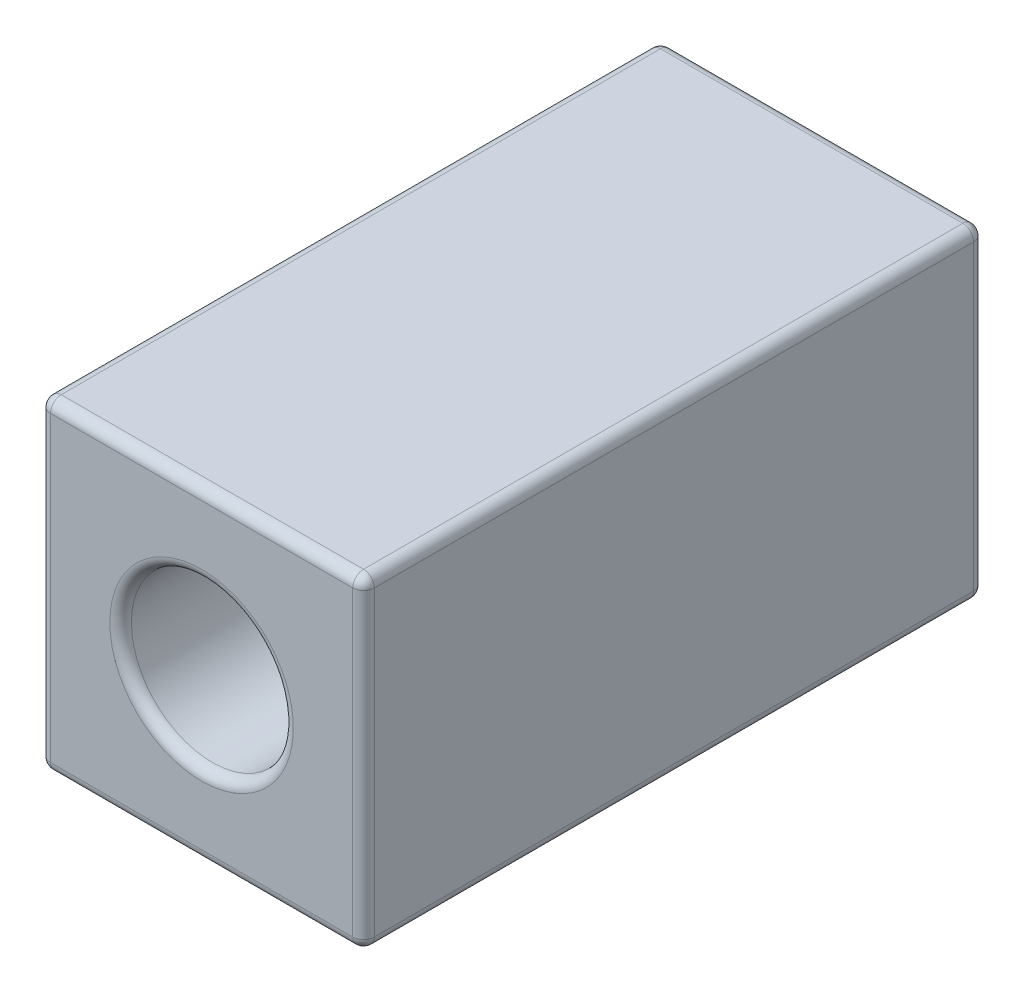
ISO-10303-21;
HEADER;
FILE_DESCRIPTION(('STEP AP214'),'2;1');
FILE_NAME('part.step','',(''),(''),'','','');
FILE_SCHEMA(('AUTOMOTIVE_DESIGN { 1 0 10303 214 1 1 1 1 }'));
ENDSEC;
DATA;
#1=APPLICATION_CONTEXT('core data for automotive mechanical design processes');
#2=APPLICATION_PROTOCOL_DEFINITION('international standard','automotive_design',2000,#1);
#3=PRODUCT_CONTEXT('',#1,'mechanical');
#4=PRODUCT('Part','Part','',(#3));
#5=PRODUCT_RELATED_PRODUCT_CATEGORY('part','',(#4));
#6=PRODUCT_DEFINITION_FORMATION('','',#4);
#7=PRODUCT_DEFINITION_CONTEXT('part definition',#1,'design');
#8=PRODUCT_DEFINITION('design','',#6,#7);
#9=PRODUCT_DEFINITION_SHAPE('','',#8);
#10=(LENGTH_UNIT() NAMED_UNIT(*) SI_UNIT(.MILLI.,.METRE.));
#11=(NAMED_UNIT(*) PLANE_ANGLE_UNIT() SI_UNIT($,.RADIAN.));
#12=(NAMED_UNIT(*) SI_UNIT($,.STERADIAN.) SOLID_ANGLE_UNIT());
#13=UNCERTAINTY_MEASURE_WITH_UNIT(LENGTH_MEASURE(1.E-05),#10,'distance_accuracy_value','');
#14=(GEOMETRIC_REPRESENTATION_CONTEXT(3) GLOBAL_UNCERTAINTY_ASSIGNED_CONTEXT((#13)) GLOBAL_UNIT_ASSIGNED_CONTEXT((#10,
#11,#12)) REPRESENTATION_CONTEXT('',''));
#15=CARTESIAN_POINT('',(0.,0.,0.));
#16=DIRECTION('',(0.,0.,1.));
#17=DIRECTION('',(1.,0.,0.));
#18=AXIS2_PLACEMENT_3D('',#15,#16,#17);
#19=CARTESIAN_POINT('',(-2.8,2.8,11.5));
#20=DIRECTION('',(0.,0.,-1.));
#21=DIRECTION('',(-1.,0.,0.));
#22=AXIS2_PLACEMENT_3D('',#19,#20,#21);
#23=PLANE('',#22);
#24=CARTESIAN_POINT('',(0.,0.,11.5));
#25=DIRECTION('',(0.,0.,-1.));
#26=DIRECTION('',(-1.,0.,0.));
#27=AXIS2_PLACEMENT_3D('',#24,#25,#26);
#28=CIRCLE('',#27,1.7);
#29=CARTESIAN_POINT('',(-1.7,0.,11.5));
#30=VERTEX_POINT('',#29);
#31=EDGE_CURVE('E11',#30,#30,#28,.T.);
#32=ORIENTED_EDGE('',*,*,#31,.T.);
#33=EDGE_LOOP('',(#32));
#34=FACE_BOUND('',#33,.T.);
#35=DIRECTION('',(0.,1.,0.));
#36=VECTOR('',#35,1.);
#37=CARTESIAN_POINT('',(2.8,2.8,11.5));
#38=LINE('',#37,#36);
#39=CARTESIAN_POINT('',(2.8,-2.8,11.5));
#40=VERTEX_POINT('',#39);
#41=CARTESIAN_POINT('',(2.8,2.8,11.5));
#42=VERTEX_POINT('',#41);
#43=EDGE_CURVE('E48',#40,#42,#38,.T.);
#44=ORIENTED_EDGE('',*,*,#43,.T.);
#45=DIRECTION('',(-1.,0.,0.));
#46=VECTOR('',#45,1.);
#47=CARTESIAN_POINT('',(-2.8,2.8,11.5));
#48=LINE('',#47,#46);
#49=CARTESIAN_POINT('',(-2.8,2.8,11.5));
#50=VERTEX_POINT('',#49);
#51=EDGE_CURVE('E41',#42,#50,#48,.T.);
#52=ORIENTED_EDGE('',*,*,#51,.T.);
#53=DIRECTION('',(0.,-1.,0.));
#54=VECTOR('',#53,1.);
#55=CARTESIAN_POINT('',(-2.8,2.8,11.5));
#56=LINE('',#55,#54);
#57=CARTESIAN_POINT('',(-2.8,-2.8,11.5));
#58=VERTEX_POINT('',#57);
#59=EDGE_CURVE('E203',#50,#58,#56,.T.);
#60=ORIENTED_EDGE('',*,*,#59,.T.);
#61=DIRECTION('',(1.,0.,0.));
#62=VECTOR('',#61,1.);
#63=CARTESIAN_POINT('',(-2.8,-2.8,11.5));
#64=LINE('',#63,#62);
#65=EDGE_CURVE('E53',#58,#40,#64,.T.);
#66=ORIENTED_EDGE('',*,*,#65,.T.);
#67=EDGE_LOOP('',(#44,#52,#60,#66));
#68=FACE_BOUND('',#67,.T.);
#69=ADVANCED_FACE('F33',(#34,#68),#23,.F.);
#70=CARTESIAN_POINT('',(-2.8,2.8,0.));
#71=DIRECTION('',(0.,0.,-1.));
#72=DIRECTION('',(-1.,0.,0.));
#73=AXIS2_PLACEMENT_3D('',#70,#71,#72);
#74=PLANE('',#73);
#75=CARTESIAN_POINT('',(0.,0.,0.));
#76=DIRECTION('',(0.,0.,-1.));
#77=DIRECTION('',(-1.,0.,0.));
#78=AXIS2_PLACEMENT_3D('',#75,#76,#77);
#79=CIRCLE('',#78,1.7);
#80=CARTESIAN_POINT('',(-1.7,0.,0.));
#81=VERTEX_POINT('',#80);
#82=EDGE_CURVE('E159',#81,#81,#79,.F.);
#83=ORIENTED_EDGE('',*,*,#82,.T.);
#84=EDGE_LOOP('',(#83));
#85=FACE_BOUND('',#84,.T.);
#86=DIRECTION('',(1.,0.,0.));
#87=VECTOR('',#86,1.);
#88=CARTESIAN_POINT('',(-2.8,-2.8,0.));
#89=LINE('',#88,#87);
#90=CARTESIAN_POINT('',(2.8,-2.8,0.));
#91=VERTEX_POINT('',#90);
#92=CARTESIAN_POINT('',(-2.8,-2.8,0.));
#93=VERTEX_POINT('',#92);
#94=EDGE_CURVE('E157',#91,#93,#89,.F.);
#95=ORIENTED_EDGE('',*,*,#94,.T.);
#96=DIRECTION('',(0.,-1.,0.));
#97=VECTOR('',#96,1.);
#98=CARTESIAN_POINT('',(-2.8,2.8,0.));
#99=LINE('',#98,#97);
#100=CARTESIAN_POINT('',(-2.8,2.8,0.));
#101=VERTEX_POINT('',#100);
#102=EDGE_CURVE('E127',#93,#101,#99,.F.);
#103=ORIENTED_EDGE('',*,*,#102,.T.);
#104=DIRECTION('',(-1.,0.,0.));
#105=VECTOR('',#104,1.);
#106=CARTESIAN_POINT('',(2.8,2.8,0.));
#107=LINE('',#106,#105);
#108=CARTESIAN_POINT('',(2.8,2.8,0.));
#109=VERTEX_POINT('',#108);
#110=EDGE_CURVE('E146',#101,#109,#107,.F.);
#111=ORIENTED_EDGE('',*,*,#110,.T.);
#112=DIRECTION('',(0.,1.,0.));
#113=VECTOR('',#112,1.);
#114=CARTESIAN_POINT('',(2.8,-2.8,0.));
#115=LINE('',#114,#113);
#116=EDGE_CURVE('E152',#109,#91,#115,.F.);
#117=ORIENTED_EDGE('',*,*,#116,.T.);
#118=EDGE_LOOP('',(#95,#103,#111,#117));
#119=FACE_BOUND('',#118,.T.);
#120=ADVANCED_FACE('F155',(#85,#119),#74,.T.);
#121=CARTESIAN_POINT('',(-2.8,2.8,11.5));
#122=DIRECTION('',(0.,0.,-1.));
#123=DIRECTION('',(-1.,0.,0.));
#124=AXIS2_PLACEMENT_3D('',#121,#122,#123);
#125=CYLINDRICAL_SURFACE('',#124,0.2);
#126=DIRECTION('',(0.,0.,-1.));
#127=VECTOR('',#126,1.);
#128=CARTESIAN_POINT('',(-2.8,3.,11.5));
#129=LINE('',#128,#127);
#130=CARTESIAN_POINT('',(-2.8,3.,11.3));
#131=VERTEX_POINT('',#130);
#132=CARTESIAN_POINT('',(-2.8,3.,0.200000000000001));
#133=VERTEX_POINT('',#132);
#134=EDGE_CURVE('E258',#131,#133,#129,.T.);
#135=ORIENTED_EDGE('',*,*,#134,.T.);
#136=CARTESIAN_POINT('',(-2.8,2.8,0.200000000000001));
#137=DIRECTION('',(0.,0.,-1.));
#138=DIRECTION('',(-1.,0.,0.));
#139=AXIS2_PLACEMENT_3D('',#136,#137,#138);
#140=CIRCLE('',#139,0.2);
#141=CARTESIAN_POINT('',(-3.,2.8,0.200000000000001));
#142=VERTEX_POINT('',#141);
#143=EDGE_CURVE('E140',#133,#142,#140,.F.);
#144=ORIENTED_EDGE('',*,*,#143,.T.);
#145=DIRECTION('',(0.,0.,-1.));
#146=VECTOR('',#145,1.);
#147=CARTESIAN_POINT('',(-3.,2.8,11.5));
#148=LINE('',#147,#146);
#149=CARTESIAN_POINT('',(-3.,2.8,11.3));
#150=VERTEX_POINT('',#149);
#151=EDGE_CURVE('E153',#150,#142,#148,.T.);
#152=ORIENTED_EDGE('',*,*,#151,.F.);
#153=CARTESIAN_POINT('',(-2.8,2.8,11.3));
#154=DIRECTION('',(0.,0.,-1.));
#155=DIRECTION('',(-1.,0.,0.));
#156=AXIS2_PLACEMENT_3D('',#153,#154,#155);
#157=CIRCLE('',#156,0.2);
#158=EDGE_CURVE('E200',#150,#131,#157,.T.);
#159=ORIENTED_EDGE('',*,*,#158,.T.);
#160=EDGE_LOOP('',(#135,#144,#152,#159));
#161=FACE_BOUND('',#160,.T.);
#162=ADVANCED_FACE('F35',(#161),#125,.T.);
#163=CARTESIAN_POINT('',(-3.,2.8,11.5));
#164=DIRECTION('',(1.,0.,0.));
#165=DIRECTION('',(0.,0.,-1.));
#166=AXIS2_PLACEMENT_3D('',#163,#164,#165);
#167=PLANE('',#166);
#168=ORIENTED_EDGE('',*,*,#151,.T.);
#169=DIRECTION('',(0.,-1.,0.));
#170=VECTOR('',#169,1.);
#171=CARTESIAN_POINT('',(-3.,-2.8,0.200000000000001));
#172=LINE('',#171,#170);
#173=CARTESIAN_POINT('',(-3.,-2.8,0.200000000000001));
#174=VERTEX_POINT('',#173);
#175=EDGE_CURVE('E130',#142,#174,#172,.T.);
#176=ORIENTED_EDGE('',*,*,#175,.T.);
#177=DIRECTION('',(0.,0.,-1.));
#178=VECTOR('',#177,1.);
#179=CARTESIAN_POINT('',(-3.,-2.8,11.5));
#180=LINE('',#179,#178);
#181=CARTESIAN_POINT('',(-3.,-2.8,11.3));
#182=VERTEX_POINT('',#181);
#183=EDGE_CURVE('E276',#182,#174,#180,.T.);
#184=ORIENTED_EDGE('',*,*,#183,.F.);
#185=DIRECTION('',(0.,-1.,0.));
#186=VECTOR('',#185,1.);
#187=CARTESIAN_POINT('',(-3.,2.8,11.3));
#188=LINE('',#187,#186);
#189=EDGE_CURVE('E172',#182,#150,#188,.F.);
#190=ORIENTED_EDGE('',*,*,#189,.T.);
#191=EDGE_LOOP('',(#168,#176,#184,#190));
#192=FACE_BOUND('',#191,.T.);
#193=ADVANCED_FACE('F299',(#192),#167,.F.);
#194=CARTESIAN_POINT('',(-2.8,-2.8,11.5));
#195=DIRECTION('',(0.,0.,-1.));
#196=DIRECTION('',(-1.,0.,0.));
#197=AXIS2_PLACEMENT_3D('',#194,#195,#196);
#198=CYLINDRICAL_SURFACE('',#197,0.2);
#199=ORIENTED_EDGE('',*,*,#183,.T.);
#200=CARTESIAN_POINT('',(-2.8,-2.8,0.200000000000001));
#201=DIRECTION('',(0.,0.,-1.));
#202=DIRECTION('',(-1.,0.,0.));
#203=AXIS2_PLACEMENT_3D('',#200,#201,#202);
#204=CIRCLE('',#203,0.2);
#205=CARTESIAN_POINT('',(-2.8,-3.,0.200000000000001));
#206=VERTEX_POINT('',#205);
#207=EDGE_CURVE('E177',#174,#206,#204,.F.);
#208=ORIENTED_EDGE('',*,*,#207,.T.);
#209=DIRECTION('',(0.,0.,-1.));
#210=VECTOR('',#209,1.);
#211=CARTESIAN_POINT('',(-2.8,-3.,11.5));
#212=LINE('',#211,#210);
#213=CARTESIAN_POINT('',(-2.8,-3.,11.3));
#214=VERTEX_POINT('',#213);
#215=EDGE_CURVE('E273',#214,#206,#212,.T.);
#216=ORIENTED_EDGE('',*,*,#215,.F.);
#217=CARTESIAN_POINT('',(-2.8,-2.8,11.3));
#218=DIRECTION('',(0.,0.,-1.));
#219=DIRECTION('',(-1.,0.,0.));
#220=AXIS2_PLACEMENT_3D('',#217,#218,#219);
#221=CIRCLE('',#220,0.2);
#222=EDGE_CURVE('E175',#214,#182,#221,.T.);
#223=ORIENTED_EDGE('',*,*,#222,.T.);
#224=EDGE_LOOP('',(#199,#208,#216,#223));
#225=FACE_BOUND('',#224,.T.);
#226=ADVANCED_FACE('F301',(#225),#198,.T.);
#227=CARTESIAN_POINT('',(-2.8,-3.,11.5));
#228=DIRECTION('',(0.,1.,0.));
#229=DIRECTION('',(0.,0.,1.));
#230=AXIS2_PLACEMENT_3D('',#227,#228,#229);
#231=PLANE('',#230);
#232=ORIENTED_EDGE('',*,*,#215,.T.);
#233=DIRECTION('',(1.,0.,0.));
#234=VECTOR('',#233,1.);
#235=CARTESIAN_POINT('',(2.8,-3.,0.200000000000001));
#236=LINE('',#235,#234);
#237=CARTESIAN_POINT('',(2.8,-3.,0.200000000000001));
#238=VERTEX_POINT('',#237);
#239=EDGE_CURVE('E181',#206,#238,#236,.T.);
#240=ORIENTED_EDGE('',*,*,#239,.T.);
#241=DIRECTION('',(0.,0.,-1.));
#242=VECTOR('',#241,1.);
#243=CARTESIAN_POINT('',(2.8,-3.,11.5));
#244=LINE('',#243,#242);
#245=CARTESIAN_POINT('',(2.8,-3.,11.3));
#246=VERTEX_POINT('',#245);
#247=EDGE_CURVE('E270',#246,#238,#244,.T.);
#248=ORIENTED_EDGE('',*,*,#247,.F.);
#249=DIRECTION('',(1.,0.,0.));
#250=VECTOR('',#249,1.);
#251=CARTESIAN_POINT('',(-2.8,-3.,11.3));
#252=LINE('',#251,#250);
#253=EDGE_CURVE('E179',#246,#214,#252,.F.);
#254=ORIENTED_EDGE('',*,*,#253,.T.);
#255=EDGE_LOOP('',(#232,#240,#248,#254));
#256=FACE_BOUND('',#255,.T.);
#257=ADVANCED_FACE('F354',(#256),#231,.F.);
#258=CARTESIAN_POINT('',(2.8,-2.8,11.5));
#259=DIRECTION('',(0.,0.,-1.));
#260=DIRECTION('',(-1.,0.,0.));
#261=AXIS2_PLACEMENT_3D('',#258,#259,#260);
#262=CYLINDRICAL_SURFACE('',#261,0.2);
#263=ORIENTED_EDGE('',*,*,#247,.T.);
#264=CARTESIAN_POINT('',(2.8,-2.8,0.200000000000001));
#265=DIRECTION('',(0.,0.,-1.));
#266=DIRECTION('',(-1.,0.,0.));
#267=AXIS2_PLACEMENT_3D('',#264,#265,#266);
#268=CIRCLE('',#267,0.2);
#269=CARTESIAN_POINT('',(3.,-2.8,0.200000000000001));
#270=VERTEX_POINT('',#269);
#271=EDGE_CURVE('E185',#238,#270,#268,.F.);
#272=ORIENTED_EDGE('',*,*,#271,.T.);
#273=DIRECTION('',(0.,0.,-1.));
#274=VECTOR('',#273,1.);
#275=CARTESIAN_POINT('',(3.,-2.8,11.5));
#276=LINE('',#275,#274);
#277=CARTESIAN_POINT('',(3.,-2.8,11.3));
#278=VERTEX_POINT('',#277);
#279=EDGE_CURVE('E267',#278,#270,#276,.T.);
#280=ORIENTED_EDGE('',*,*,#279,.F.);
#281=CARTESIAN_POINT('',(2.8,-2.8,11.3));
#282=DIRECTION('',(0.,0.,-1.));
#283=DIRECTION('',(-1.,0.,0.));
#284=AXIS2_PLACEMENT_3D('',#281,#282,#283);
#285=CIRCLE('',#284,0.2);
#286=EDGE_CURVE('E183',#278,#246,#285,.T.);
#287=ORIENTED_EDGE('',*,*,#286,.T.);
#288=EDGE_LOOP('',(#263,#272,#280,#287));
#289=FACE_BOUND('',#288,.T.);
#290=ADVANCED_FACE('F350',(#289),#262,.T.);
#291=CARTESIAN_POINT('',(3.,2.8,11.5));
#292=DIRECTION('',(-1.,0.,0.));
#293=DIRECTION('',(0.,0.,1.));
#294=AXIS2_PLACEMENT_3D('',#291,#292,#293);
#295=PLANE('',#294);
#296=ORIENTED_EDGE('',*,*,#279,.T.);
#297=DIRECTION('',(0.,1.,0.));
#298=VECTOR('',#297,1.);
#299=CARTESIAN_POINT('',(3.,2.8,0.200000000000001));
#300=LINE('',#299,#298);
#301=CARTESIAN_POINT('',(3.,2.8,0.200000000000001));
#302=VERTEX_POINT('',#301);
#303=EDGE_CURVE('E189',#270,#302,#300,.T.);
#304=ORIENTED_EDGE('',*,*,#303,.T.);
#305=DIRECTION('',(0.,0.,-1.));
#306=VECTOR('',#305,1.);
#307=CARTESIAN_POINT('',(3.,2.8,11.5));
#308=LINE('',#307,#306);
#309=CARTESIAN_POINT('',(3.,2.8,11.3));
#310=VERTEX_POINT('',#309);
#311=EDGE_CURVE('E264',#310,#302,#308,.T.);
#312=ORIENTED_EDGE('',*,*,#311,.F.);
#313=DIRECTION('',(0.,1.,0.));
#314=VECTOR('',#313,1.);
#315=CARTESIAN_POINT('',(3.,2.8,11.3));
#316=LINE('',#315,#314);
#317=EDGE_CURVE('E187',#310,#278,#316,.F.);
#318=ORIENTED_EDGE('',*,*,#317,.T.);
#319=EDGE_LOOP('',(#296,#304,#312,#318));
#320=FACE_BOUND('',#319,.T.);
#321=ADVANCED_FACE('F347',(#320),#295,.F.);
#322=CARTESIAN_POINT('',(2.8,2.8,11.5));
#323=DIRECTION('',(0.,0.,-1.));
#324=DIRECTION('',(-1.,0.,0.));
#325=AXIS2_PLACEMENT_3D('',#322,#323,#324);
#326=CYLINDRICAL_SURFACE('',#325,0.2);
#327=ORIENTED_EDGE('',*,*,#311,.T.);
#328=CARTESIAN_POINT('',(2.8,2.8,0.200000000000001));
#329=DIRECTION('',(0.,0.,-1.));
#330=DIRECTION('',(-1.,0.,0.));
#331=AXIS2_PLACEMENT_3D('',#328,#329,#330);
#332=CIRCLE('',#331,0.2);
#333=CARTESIAN_POINT('',(2.8,3.,0.200000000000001));
#334=VERTEX_POINT('',#333);
#335=EDGE_CURVE('E193',#302,#334,#332,.F.);
#336=ORIENTED_EDGE('',*,*,#335,.T.);
#337=DIRECTION('',(0.,0.,-1.));
#338=VECTOR('',#337,1.);
#339=CARTESIAN_POINT('',(2.8,3.,11.5));
#340=LINE('',#339,#338);
#341=CARTESIAN_POINT('',(2.8,3.,11.3));
#342=VERTEX_POINT('',#341);
#343=EDGE_CURVE('E261',#342,#334,#340,.T.);
#344=ORIENTED_EDGE('',*,*,#343,.F.);
#345=CARTESIAN_POINT('',(2.8,2.8,11.3));
#346=DIRECTION('',(0.,0.,-1.));
#347=DIRECTION('',(-1.,0.,0.));
#348=AXIS2_PLACEMENT_3D('',#345,#346,#347);
#349=CIRCLE('',#348,0.2);
#350=EDGE_CURVE('E191',#342,#310,#349,.T.);
#351=ORIENTED_EDGE('',*,*,#350,.T.);
#352=EDGE_LOOP('',(#327,#336,#344,#351));
#353=FACE_BOUND('',#352,.T.);
#354=ADVANCED_FACE('F323',(#353),#326,.T.);
#355=CARTESIAN_POINT('',(-2.8,3.,11.5));
#356=DIRECTION('',(0.,-1.,0.));
#357=DIRECTION('',(0.,0.,-1.));
#358=AXIS2_PLACEMENT_3D('',#355,#356,#357);
#359=PLANE('',#358);
#360=ORIENTED_EDGE('',*,*,#343,.T.);
#361=DIRECTION('',(-1.,0.,0.));
#362=VECTOR('',#361,1.);
#363=CARTESIAN_POINT('',(-2.8,3.,0.200000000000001));
#364=LINE('',#363,#362);
#365=EDGE_CURVE('E198',#334,#133,#364,.T.);
#366=ORIENTED_EDGE('',*,*,#365,.T.);
#367=ORIENTED_EDGE('',*,*,#134,.F.);
#368=DIRECTION('',(-1.,0.,0.));
#369=VECTOR('',#368,1.);
#370=CARTESIAN_POINT('',(-2.8,3.,11.3));
#371=LINE('',#370,#369);
#372=EDGE_CURVE('E195',#131,#342,#371,.F.);
#373=ORIENTED_EDGE('',*,*,#372,.T.);
#374=EDGE_LOOP('',(#360,#366,#367,#373));
#375=FACE_BOUND('',#374,.T.);
#376=ADVANCED_FACE('F322',(#375),#359,.F.);
#377=CARTESIAN_POINT('',(0.,0.,11.5));
#378=DIRECTION('',(0.,0.,-1.));
#379=DIRECTION('',(-1.,0.,0.));
#380=AXIS2_PLACEMENT_3D('',#377,#378,#379);
#381=CYLINDRICAL_SURFACE('',#380,1.5);
#382=CARTESIAN_POINT('',(0.,0.,0.200000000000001));
#383=DIRECTION('',(0.,0.,-1.));
#384=DIRECTION('',(-1.,0.,0.));
#385=AXIS2_PLACEMENT_3D('',#382,#383,#384);
#386=CIRCLE('',#385,1.5);
#387=CARTESIAN_POINT('',(-1.5,0.,0.200000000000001));
#388=VERTEX_POINT('',#387);
#389=EDGE_CURVE('E169',#388,#388,#386,.T.);
#390=ORIENTED_EDGE('',*,*,#389,.T.);
#391=EDGE_LOOP('',(#390));
#392=FACE_BOUND('',#391,.T.);
#393=CARTESIAN_POINT('',(0.,0.,11.3));
#394=DIRECTION('',(0.,0.,-1.));
#395=DIRECTION('',(-1.,0.,0.));
#396=AXIS2_PLACEMENT_3D('',#393,#394,#395);
#397=CIRCLE('',#396,1.5);
#398=CARTESIAN_POINT('',(-1.5,0.,11.3));
#399=VERTEX_POINT('',#398);
#400=EDGE_CURVE('E162',#399,#399,#397,.F.);
#401=ORIENTED_EDGE('',*,*,#400,.T.);
#402=EDGE_LOOP('',(#401));
#403=FACE_BOUND('',#402,.T.);
#404=ADVANCED_FACE('F344',(#392,#403),#381,.F.);
#405=CARTESIAN_POINT('',(0.,0.,0.200000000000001));
#406=DIRECTION('',(0.,0.,-1.));
#407=DIRECTION('',(-1.,0.,0.));
#408=AXIS2_PLACEMENT_3D('',#405,#406,#407);
#409=TOROIDAL_SURFACE('',#408,1.7,0.2);
#410=ORIENTED_EDGE('',*,*,#389,.F.);
#411=EDGE_LOOP('',(#410));
#412=FACE_BOUND('',#411,.T.);
#413=ORIENTED_EDGE('',*,*,#82,.F.);
#414=EDGE_LOOP('',(#413));
#415=FACE_BOUND('',#414,.T.);
#416=ADVANCED_FACE('F391',(#412,#415),#409,.T.);
#417=CARTESIAN_POINT('',(2.8,2.8,0.200000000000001));
#418=DIRECTION('',(0.,-1.,0.));
#419=DIRECTION('',(0.,0.,-1.));
#420=AXIS2_PLACEMENT_3D('',#417,#418,#419);
#421=CYLINDRICAL_SURFACE('',#420,0.2);
#422=CARTESIAN_POINT('',(2.8,2.8,0.200000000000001));
#423=DIRECTION('',(0.,1.,0.));
#424=DIRECTION('',(0.,0.,1.));
#425=AXIS2_PLACEMENT_3D('',#422,#423,#424);
#426=CIRCLE('',#425,0.2);
#427=EDGE_CURVE('E255',#302,#109,#426,.T.);
#428=ORIENTED_EDGE('',*,*,#427,.F.);
#429=ORIENTED_EDGE('',*,*,#303,.F.);
#430=CARTESIAN_POINT('',(2.8,-2.8,0.2));
#431=DIRECTION('',(0.,-1.,0.));
#432=DIRECTION('',(1.,0.,0.));
#433=AXIS2_PLACEMENT_3D('',#430,#431,#432);
#434=CIRCLE('',#433,0.2);
#435=EDGE_CURVE('E252',#91,#270,#434,.T.);
#436=ORIENTED_EDGE('',*,*,#435,.F.);
#437=ORIENTED_EDGE('',*,*,#116,.F.);
#438=EDGE_LOOP('',(#428,#429,#436,#437));
#439=FACE_BOUND('',#438,.T.);
#440=ADVANCED_FACE('F285',(#439),#421,.T.);
#441=CARTESIAN_POINT('',(2.8,2.8,0.200000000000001));
#442=DIRECTION('',(0.,0.,1.));
#443=DIRECTION('',(1.,0.,0.));
#444=AXIS2_PLACEMENT_3D('',#441,#442,#443);
#445=SPHERICAL_SURFACE('',#444,0.2);
#446=ORIENTED_EDGE('',*,*,#335,.F.);
#447=ORIENTED_EDGE('',*,*,#427,.T.);
#448=CARTESIAN_POINT('',(2.8,2.8,0.200000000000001));
#449=DIRECTION('',(-1.,0.,0.));
#450=DIRECTION('',(0.,-1.,0.));
#451=AXIS2_PLACEMENT_3D('',#448,#449,#450);
#452=CIRCLE('',#451,0.2);
#453=EDGE_CURVE('E149',#334,#109,#452,.T.);
#454=ORIENTED_EDGE('',*,*,#453,.F.);
#455=EDGE_LOOP('',(#446,#447,#454));
#456=FACE_BOUND('',#455,.T.);
#457=ADVANCED_FACE('F326',(#456),#445,.T.);
#458=CARTESIAN_POINT('',(2.8,-2.8,0.200000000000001));
#459=DIRECTION('',(0.,0.,1.));
#460=DIRECTION('',(1.,0.,0.));
#461=AXIS2_PLACEMENT_3D('',#458,#459,#460);
#462=SPHERICAL_SURFACE('',#461,0.2);
#463=ORIENTED_EDGE('',*,*,#435,.T.);
#464=ORIENTED_EDGE('',*,*,#271,.F.);
#465=CARTESIAN_POINT('',(2.8,-2.8,0.2));
#466=DIRECTION('',(-1.,0.,0.));
#467=DIRECTION('',(0.,-1.,0.));
#468=AXIS2_PLACEMENT_3D('',#465,#466,#467);
#469=CIRCLE('',#468,0.2);
#470=EDGE_CURVE('E143',#91,#238,#469,.T.);
#471=ORIENTED_EDGE('',*,*,#470,.F.);
#472=EDGE_LOOP('',(#463,#464,#471));
#473=FACE_BOUND('',#472,.T.);
#474=ADVANCED_FACE('F288',(#473),#462,.T.);
#475=CARTESIAN_POINT('',(-2.8,2.8,0.200000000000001));
#476=DIRECTION('',(1.,0.,0.));
#477=DIRECTION('',(0.,0.,-1.));
#478=AXIS2_PLACEMENT_3D('',#475,#476,#477);
#479=CYLINDRICAL_SURFACE('',#478,0.2);
#480=ORIENTED_EDGE('',*,*,#453,.T.);
#481=ORIENTED_EDGE('',*,*,#110,.F.);
#482=CARTESIAN_POINT('',(-2.8,2.8,0.200000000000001));
#483=DIRECTION('',(-1.,0.,0.));
#484=DIRECTION('',(0.,0.,1.));
#485=AXIS2_PLACEMENT_3D('',#482,#483,#484);
#486=CIRCLE('',#485,0.2);
#487=EDGE_CURVE('E137',#133,#101,#486,.T.);
#488=ORIENTED_EDGE('',*,*,#487,.F.);
#489=ORIENTED_EDGE('',*,*,#365,.F.);
#490=EDGE_LOOP('',(#480,#481,#488,#489));
#491=FACE_BOUND('',#490,.T.);
#492=ADVANCED_FACE('F147',(#491),#479,.T.);
#493=CARTESIAN_POINT('',(-2.8,-2.8,0.200000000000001));
#494=DIRECTION('',(-1.,0.,0.));
#495=DIRECTION('',(0.,0.,1.));
#496=AXIS2_PLACEMENT_3D('',#493,#494,#495);
#497=CYLINDRICAL_SURFACE('',#496,0.2);
#498=ORIENTED_EDGE('',*,*,#470,.T.);
#499=ORIENTED_EDGE('',*,*,#239,.F.);
#500=CARTESIAN_POINT('',(-2.8,-2.8,0.2));
#501=DIRECTION('',(-1.,0.,0.));
#502=DIRECTION('',(0.,-1.,0.));
#503=AXIS2_PLACEMENT_3D('',#500,#501,#502);
#504=CIRCLE('',#503,0.2);
#505=EDGE_CURVE('E133',#93,#206,#504,.T.);
#506=ORIENTED_EDGE('',*,*,#505,.F.);
#507=ORIENTED_EDGE('',*,*,#94,.F.);
#508=EDGE_LOOP('',(#498,#499,#506,#507));
#509=FACE_BOUND('',#508,.T.);
#510=ADVANCED_FACE('F291',(#509),#497,.T.);
#511=CARTESIAN_POINT('',(-2.8,2.8,0.200000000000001));
#512=DIRECTION('',(0.,0.,1.));
#513=DIRECTION('',(1.,0.,0.));
#514=AXIS2_PLACEMENT_3D('',#511,#512,#513);
#515=SPHERICAL_SURFACE('',#514,0.2);
#516=ORIENTED_EDGE('',*,*,#143,.F.);
#517=ORIENTED_EDGE('',*,*,#487,.T.);
#518=CARTESIAN_POINT('',(-2.8,2.8,0.200000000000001));
#519=DIRECTION('',(0.,-1.,0.));
#520=DIRECTION('',(1.,0.,0.));
#521=AXIS2_PLACEMENT_3D('',#518,#519,#520);
#522=CIRCLE('',#521,0.2);
#523=EDGE_CURVE('E123',#142,#101,#522,.T.);
#524=ORIENTED_EDGE('',*,*,#523,.F.);
#525=EDGE_LOOP('',(#516,#517,#524));
#526=FACE_BOUND('',#525,.T.);
#527=ADVANCED_FACE('F139',(#526),#515,.T.);
#528=CARTESIAN_POINT('',(-2.8,-2.8,0.200000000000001));
#529=DIRECTION('',(0.,0.,1.));
#530=DIRECTION('',(1.,0.,0.));
#531=AXIS2_PLACEMENT_3D('',#528,#529,#530);
#532=SPHERICAL_SURFACE('',#531,0.2);
#533=ORIENTED_EDGE('',*,*,#505,.T.);
#534=ORIENTED_EDGE('',*,*,#207,.F.);
#535=CARTESIAN_POINT('',(-2.8,-2.8,0.2));
#536=DIRECTION('',(0.,1.,0.));
#537=DIRECTION('',(-1.,0.,0.));
#538=AXIS2_PLACEMENT_3D('',#535,#536,#537);
#539=CIRCLE('',#538,0.2);
#540=EDGE_CURVE('E134',#93,#174,#539,.T.);
#541=ORIENTED_EDGE('',*,*,#540,.F.);
#542=EDGE_LOOP('',(#533,#534,#541));
#543=FACE_BOUND('',#542,.T.);
#544=ADVANCED_FACE('F294',(#543),#532,.T.);
#545=CARTESIAN_POINT('',(-2.8,2.8,0.200000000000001));
#546=DIRECTION('',(0.,1.,0.));
#547=DIRECTION('',(0.,0.,1.));
#548=AXIS2_PLACEMENT_3D('',#545,#546,#547);
#549=CYLINDRICAL_SURFACE('',#548,0.2);
#550=ORIENTED_EDGE('',*,*,#523,.T.);
#551=ORIENTED_EDGE('',*,*,#102,.F.);
#552=ORIENTED_EDGE('',*,*,#540,.T.);
#553=ORIENTED_EDGE('',*,*,#175,.F.);
#554=EDGE_LOOP('',(#550,#551,#552,#553));
#555=FACE_BOUND('',#554,.T.);
#556=ADVANCED_FACE('F125',(#555),#549,.T.);
#557=CARTESIAN_POINT('',(0.,0.,11.3));
#558=DIRECTION('',(0.,0.,-1.));
#559=DIRECTION('',(-1.,0.,0.));
#560=AXIS2_PLACEMENT_3D('',#557,#558,#559);
#561=TOROIDAL_SURFACE('',#560,1.7,0.2);
#562=ORIENTED_EDGE('',*,*,#31,.F.);
#563=EDGE_LOOP('',(#562));
#564=FACE_BOUND('',#563,.T.);
#565=ORIENTED_EDGE('',*,*,#400,.F.);
#566=EDGE_LOOP('',(#565));
#567=FACE_BOUND('',#566,.T.);
#568=ADVANCED_FACE('F447',(#564,#567),#561,.T.);
#569=CARTESIAN_POINT('',(-2.8,-2.8,11.3));
#570=DIRECTION('',(1.,0.,0.));
#571=DIRECTION('',(0.,0.,-1.));
#572=AXIS2_PLACEMENT_3D('',#569,#570,#571);
#573=CYLINDRICAL_SURFACE('',#572,0.2);
#574=CARTESIAN_POINT('',(-2.8,-2.8,11.3));
#575=DIRECTION('',(-1.,0.,0.));
#576=DIRECTION('',(0.,0.,1.));
#577=AXIS2_PLACEMENT_3D('',#574,#575,#576);
#578=CIRCLE('',#577,0.2);
#579=EDGE_CURVE('E237',#214,#58,#578,.T.);
#580=ORIENTED_EDGE('',*,*,#579,.F.);
#581=ORIENTED_EDGE('',*,*,#253,.F.);
#582=CARTESIAN_POINT('',(2.8,-2.8,11.3));
#583=DIRECTION('',(1.,0.,0.));
#584=DIRECTION('',(0.,1.,0.));
#585=AXIS2_PLACEMENT_3D('',#582,#583,#584);
#586=CIRCLE('',#585,0.2);
#587=EDGE_CURVE('E243',#40,#246,#586,.T.);
#588=ORIENTED_EDGE('',*,*,#587,.F.);
#589=ORIENTED_EDGE('',*,*,#65,.F.);
#590=EDGE_LOOP('',(#580,#581,#588,#589));
#591=FACE_BOUND('',#590,.T.);
#592=ADVANCED_FACE('F306',(#591),#573,.T.);
#593=CARTESIAN_POINT('',(2.8,-2.8,11.3));
#594=DIRECTION('',(0.,0.,1.));
#595=DIRECTION('',(1.,0.,0.));
#596=AXIS2_PLACEMENT_3D('',#593,#594,#595);
#597=SPHERICAL_SURFACE('',#596,0.2);
#598=ORIENTED_EDGE('',*,*,#587,.T.);
#599=ORIENTED_EDGE('',*,*,#286,.F.);
#600=CARTESIAN_POINT('',(2.8,-2.8,11.3));
#601=DIRECTION('',(0.,1.,0.));
#602=DIRECTION('',(-1.,0.,0.));
#603=AXIS2_PLACEMENT_3D('',#600,#601,#602);
#604=CIRCLE('',#603,0.2);
#605=EDGE_CURVE('E234',#40,#278,#604,.T.);
#606=ORIENTED_EDGE('',*,*,#605,.F.);
#607=EDGE_LOOP('',(#598,#599,#606));
#608=FACE_BOUND('',#607,.T.);
#609=ADVANCED_FACE('F310',(#608),#597,.T.);
#610=CARTESIAN_POINT('',(-2.8,-2.8,11.3));
#611=DIRECTION('',(0.,0.,1.));
#612=DIRECTION('',(1.,0.,0.));
#613=AXIS2_PLACEMENT_3D('',#610,#611,#612);
#614=SPHERICAL_SURFACE('',#613,0.2);
#615=ORIENTED_EDGE('',*,*,#222,.F.);
#616=ORIENTED_EDGE('',*,*,#579,.T.);
#617=CARTESIAN_POINT('',(-2.8,-2.8,11.3));
#618=DIRECTION('',(0.,1.,0.));
#619=DIRECTION('',(-1.,0.,0.));
#620=AXIS2_PLACEMENT_3D('',#617,#618,#619);
#621=CIRCLE('',#620,0.2);
#622=EDGE_CURVE('E230',#182,#58,#621,.T.);
#623=ORIENTED_EDGE('',*,*,#622,.F.);
#624=EDGE_LOOP('',(#615,#616,#623));
#625=FACE_BOUND('',#624,.T.);
#626=ADVANCED_FACE('F303',(#625),#614,.T.);
#627=CARTESIAN_POINT('',(2.8,2.8,11.3));
#628=DIRECTION('',(0.,1.,0.));
#629=DIRECTION('',(0.,0.,1.));
#630=AXIS2_PLACEMENT_3D('',#627,#628,#629);
#631=CYLINDRICAL_SURFACE('',#630,0.2);
#632=ORIENTED_EDGE('',*,*,#605,.T.);
#633=ORIENTED_EDGE('',*,*,#317,.F.);
#634=CARTESIAN_POINT('',(2.8,2.8,11.3));
#635=DIRECTION('',(0.,1.,0.));
#636=DIRECTION('',(-1.,0.,0.));
#637=AXIS2_PLACEMENT_3D('',#634,#635,#636);
#638=CIRCLE('',#637,0.2);
#639=EDGE_CURVE('E225',#42,#310,#638,.T.);
#640=ORIENTED_EDGE('',*,*,#639,.F.);
#641=ORIENTED_EDGE('',*,*,#43,.F.);
#642=EDGE_LOOP('',(#632,#633,#640,#641));
#643=FACE_BOUND('',#642,.T.);
#644=ADVANCED_FACE('F313',(#643),#631,.T.);
#645=CARTESIAN_POINT('',(-2.8,2.8,11.3));
#646=DIRECTION('',(0.,-1.,0.));
#647=DIRECTION('',(0.,0.,-1.));
#648=AXIS2_PLACEMENT_3D('',#645,#646,#647);
#649=CYLINDRICAL_SURFACE('',#648,0.2);
#650=ORIENTED_EDGE('',*,*,#622,.T.);
#651=ORIENTED_EDGE('',*,*,#59,.F.);
#652=CARTESIAN_POINT('',(-2.8,2.8,11.3));
#653=DIRECTION('',(0.,1.,0.));
#654=DIRECTION('',(0.,0.,1.));
#655=AXIS2_PLACEMENT_3D('',#652,#653,#654);
#656=CIRCLE('',#655,0.2);
#657=EDGE_CURVE('E221',#150,#50,#656,.T.);
#658=ORIENTED_EDGE('',*,*,#657,.F.);
#659=ORIENTED_EDGE('',*,*,#189,.F.);
#660=EDGE_LOOP('',(#650,#651,#658,#659));
#661=FACE_BOUND('',#660,.T.);
#662=ADVANCED_FACE('F228',(#661),#649,.T.);
#663=CARTESIAN_POINT('',(2.8,2.8,11.3));
#664=DIRECTION('',(0.,0.,1.));
#665=DIRECTION('',(1.,0.,0.));
#666=AXIS2_PLACEMENT_3D('',#663,#664,#665);
#667=SPHERICAL_SURFACE('',#666,0.2);
#668=ORIENTED_EDGE('',*,*,#639,.T.);
#669=ORIENTED_EDGE('',*,*,#350,.F.);
#670=CARTESIAN_POINT('',(2.8,2.8,11.3));
#671=DIRECTION('',(-1.,0.,0.));
#672=DIRECTION('',(0.,-1.,0.));
#673=AXIS2_PLACEMENT_3D('',#670,#671,#672);
#674=CIRCLE('',#673,0.2);
#675=EDGE_CURVE('E212',#42,#342,#674,.T.);
#676=ORIENTED_EDGE('',*,*,#675,.F.);
#677=EDGE_LOOP('',(#668,#669,#676));
#678=FACE_BOUND('',#677,.T.);
#679=ADVANCED_FACE('F315',(#678),#667,.T.);
#680=CARTESIAN_POINT('',(-2.8,2.8,11.3));
#681=DIRECTION('',(0.,0.,1.));
#682=DIRECTION('',(1.,0.,0.));
#683=AXIS2_PLACEMENT_3D('',#680,#681,#682);
#684=SPHERICAL_SURFACE('',#683,0.2);
#685=ORIENTED_EDGE('',*,*,#158,.F.);
#686=ORIENTED_EDGE('',*,*,#657,.T.);
#687=CARTESIAN_POINT('',(-2.8,2.8,11.3));
#688=DIRECTION('',(1.,0.,0.));
#689=DIRECTION('',(0.,1.,0.));
#690=AXIS2_PLACEMENT_3D('',#687,#688,#689);
#691=CIRCLE('',#690,0.2);
#692=EDGE_CURVE('E215',#131,#50,#691,.T.);
#693=ORIENTED_EDGE('',*,*,#692,.F.);
#694=EDGE_LOOP('',(#685,#686,#693));
#695=FACE_BOUND('',#694,.T.);
#696=ADVANCED_FACE('F222',(#695),#684,.T.);
#697=CARTESIAN_POINT('',(-2.8,2.8,11.3));
#698=DIRECTION('',(-1.,0.,0.));
#699=DIRECTION('',(0.,0.,1.));
#700=AXIS2_PLACEMENT_3D('',#697,#698,#699);
#701=CYLINDRICAL_SURFACE('',#700,0.2);
#702=ORIENTED_EDGE('',*,*,#675,.T.);
#703=ORIENTED_EDGE('',*,*,#372,.F.);
#704=ORIENTED_EDGE('',*,*,#692,.T.);
#705=ORIENTED_EDGE('',*,*,#51,.F.);
#706=EDGE_LOOP('',(#702,#703,#704,#705));
#707=FACE_BOUND('',#706,.T.);
#708=ADVANCED_FACE('F209',(#707),#701,.T.);
#709=CLOSED_SHELL('',(#69,#120,#162,#193,#226,#257,#290,#321,#354,#376,#404,#416,#440,#457,#474,
#492,#510,#527,#544,#556,#568,#592,#609,#626,#644,#662,#679,#696,#708));
#710=MANIFOLD_SOLID_BREP('B2',#709);
#711=ADVANCED_BREP_SHAPE_REPRESENTATION('',(#18,#710),#14);
#712=SHAPE_DEFINITION_REPRESENTATION(#9,#711);
ENDSEC;
END-ISO-10303-21;
